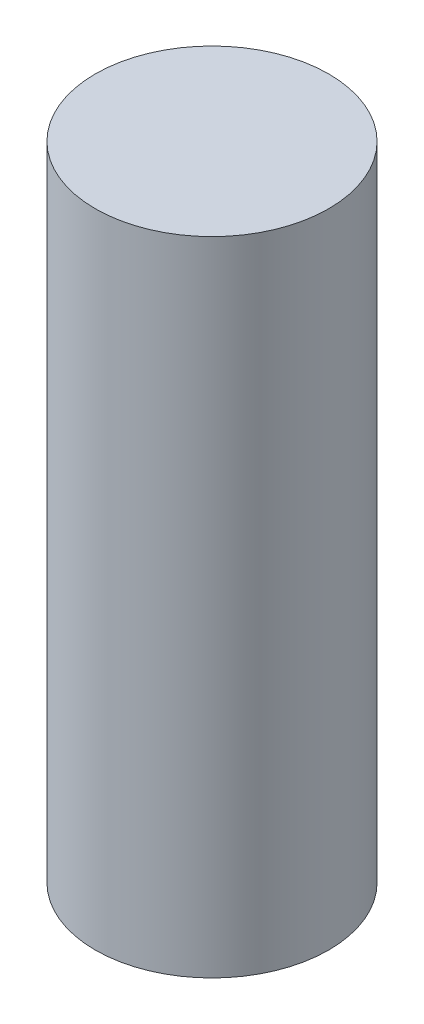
ISO-10303-21;
HEADER;
FILE_DESCRIPTION(('STEP AP214'),'2;1');
FILE_NAME('part.step','',(''),(''),'','','');
FILE_SCHEMA(('AUTOMOTIVE_DESIGN { 1 0 10303 214 1 1 1 1 }'));
ENDSEC;
DATA;
#1=APPLICATION_CONTEXT('core data for automotive mechanical design processes');
#2=APPLICATION_PROTOCOL_DEFINITION('international standard','automotive_design',2000,#1);
#3=PRODUCT_CONTEXT('',#1,'mechanical');
#4=PRODUCT('Part','Part','',(#3));
#5=PRODUCT_RELATED_PRODUCT_CATEGORY('part','',(#4));
#6=PRODUCT_DEFINITION_FORMATION('','',#4);
#7=PRODUCT_DEFINITION_CONTEXT('part definition',#1,'design');
#8=PRODUCT_DEFINITION('design','',#6,#7);
#9=PRODUCT_DEFINITION_SHAPE('','',#8);
#10=(LENGTH_UNIT() NAMED_UNIT(*) SI_UNIT(.MILLI.,.METRE.));
#11=(NAMED_UNIT(*) PLANE_ANGLE_UNIT() SI_UNIT($,.RADIAN.));
#12=(NAMED_UNIT(*) SI_UNIT($,.STERADIAN.) SOLID_ANGLE_UNIT());
#13=UNCERTAINTY_MEASURE_WITH_UNIT(LENGTH_MEASURE(1.E-05),#10,'distance_accuracy_value','');
#14=(GEOMETRIC_REPRESENTATION_CONTEXT(3) GLOBAL_UNCERTAINTY_ASSIGNED_CONTEXT((#13)) GLOBAL_UNIT_ASSIGNED_CONTEXT((#10,
#11,#12)) REPRESENTATION_CONTEXT('',''));
#15=CARTESIAN_POINT('',(0.,0.,0.));
#16=DIRECTION('',(0.,0.,1.));
#17=DIRECTION('',(1.,0.,0.));
#18=AXIS2_PLACEMENT_3D('',#15,#16,#17);
#19=CARTESIAN_POINT('',(0.,10.,0.));
#20=DIRECTION('',(0.,-1.,0.));
#21=DIRECTION('',(0.,0.,-1.));
#22=AXIS2_PLACEMENT_3D('',#19,#20,#21);
#23=CYLINDRICAL_SURFACE('',#22,1.);
#24=CARTESIAN_POINT('',(0.,10.,0.));
#25=DIRECTION('',(0.,-1.,0.));
#26=DIRECTION('',(0.,0.,-1.));
#27=AXIS2_PLACEMENT_3D('',#24,#25,#26);
#28=CIRCLE('',#27,1.);
#29=CARTESIAN_POINT('',(0.,10.,-1.));
#30=VERTEX_POINT('',#29);
#31=EDGE_CURVE('E10',#30,#30,#28,.T.);
#32=ORIENTED_EDGE('',*,*,#31,.T.);
#33=EDGE_LOOP('',(#32));
#34=FACE_BOUND('',#33,.T.);
#35=CARTESIAN_POINT('',(0.,4.5,0.));
#36=DIRECTION('',(0.,-1.,0.));
#37=DIRECTION('',(0.,0.,-1.));
#38=AXIS2_PLACEMENT_3D('',#35,#36,#37);
#39=CIRCLE('',#38,1.);
#40=CARTESIAN_POINT('',(0.,4.5,-1.));
#41=VERTEX_POINT('',#40);
#42=EDGE_CURVE('E39',#41,#41,#39,.T.);
#43=ORIENTED_EDGE('',*,*,#42,.F.);
#44=EDGE_LOOP('',(#43));
#45=FACE_BOUND('',#44,.T.);
#46=ADVANCED_FACE('F33',(#34,#45),#23,.T.);
#47=CARTESIAN_POINT('',(1.,10.,0.));
#48=DIRECTION('',(0.,1.,0.));
#49=DIRECTION('',(0.,0.,1.));
#50=AXIS2_PLACEMENT_3D('',#47,#48,#49);
#51=PLANE('',#50);
#52=ORIENTED_EDGE('',*,*,#31,.F.);
#53=EDGE_LOOP('',(#52));
#54=FACE_BOUND('',#53,.T.);
#55=ADVANCED_FACE('F48',(#54),#51,.T.);
#56=CARTESIAN_POINT('',(0.,4.5,0.));
#57=DIRECTION('',(0.,-1.,0.));
#58=DIRECTION('',(0.,0.,-1.));
#59=AXIS2_PLACEMENT_3D('',#56,#57,#58);
#60=PLANE('',#59);
#61=ORIENTED_EDGE('',*,*,#42,.T.);
#62=EDGE_LOOP('',(#61));
#63=FACE_BOUND('',#62,.T.);
#64=ADVANCED_FACE('F45',(#63),#60,.T.);
#65=CLOSED_SHELL('',(#46,#55,#64));
#66=MANIFOLD_SOLID_BREP('B2',#65);
#67=ADVANCED_BREP_SHAPE_REPRESENTATION('',(#18,#66),#14);
#68=SHAPE_DEFINITION_REPRESENTATION(#9,#67);
ENDSEC;
END-ISO-10303-21;
